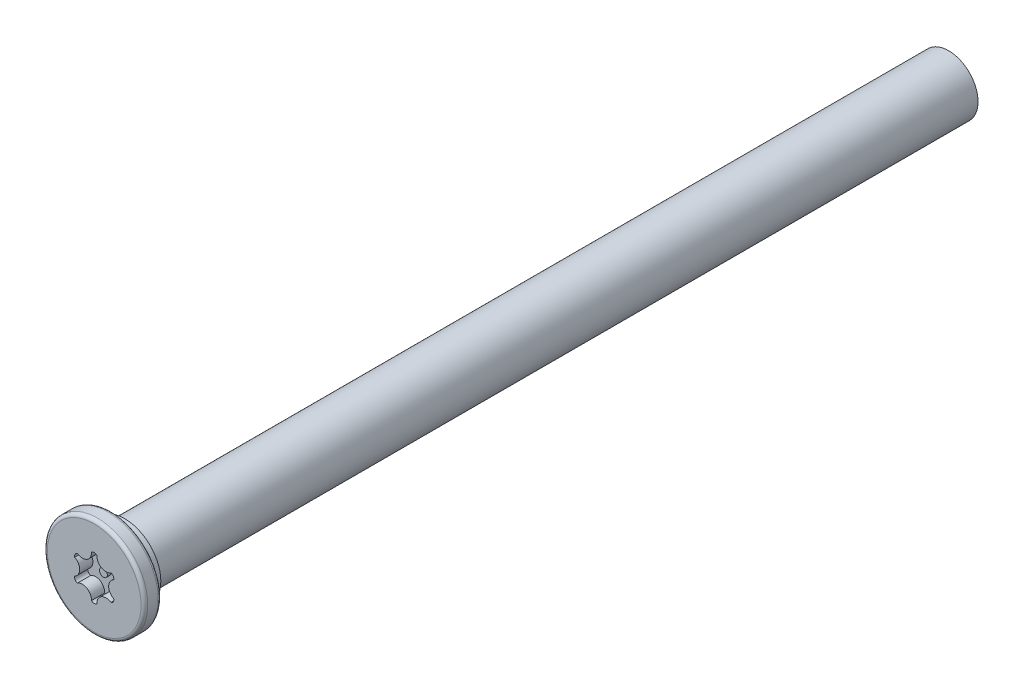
ISO-10303-21;
HEADER;
FILE_DESCRIPTION(('STEP AP214'),'2;1');
FILE_NAME('part.step','',(''),(''),'','','');
FILE_SCHEMA(('AUTOMOTIVE_DESIGN { 1 0 10303 214 1 1 1 1 }'));
ENDSEC;
DATA;
#1=APPLICATION_CONTEXT('core data for automotive mechanical design processes');
#2=APPLICATION_PROTOCOL_DEFINITION('international standard','automotive_design',2000,#1);
#3=PRODUCT_CONTEXT('',#1,'mechanical');
#4=PRODUCT('Part','Part','',(#3));
#5=PRODUCT_RELATED_PRODUCT_CATEGORY('part','',(#4));
#6=PRODUCT_DEFINITION_FORMATION('','',#4);
#7=PRODUCT_DEFINITION_CONTEXT('part definition',#1,'design');
#8=PRODUCT_DEFINITION('design','',#6,#7);
#9=PRODUCT_DEFINITION_SHAPE('','',#8);
#10=(LENGTH_UNIT() NAMED_UNIT(*) SI_UNIT(.MILLI.,.METRE.));
#11=(NAMED_UNIT(*) PLANE_ANGLE_UNIT() SI_UNIT($,.RADIAN.));
#12=(NAMED_UNIT(*) SI_UNIT($,.STERADIAN.) SOLID_ANGLE_UNIT());
#13=UNCERTAINTY_MEASURE_WITH_UNIT(LENGTH_MEASURE(1.E-05),#10,'distance_accuracy_value','');
#14=(GEOMETRIC_REPRESENTATION_CONTEXT(3) GLOBAL_UNCERTAINTY_ASSIGNED_CONTEXT((#13)) GLOBAL_UNIT_ASSIGNED_CONTEXT((#10,
#11,#12)) REPRESENTATION_CONTEXT('',''));
#15=CARTESIAN_POINT('',(0.,0.,0.));
#16=DIRECTION('',(0.,0.,1.));
#17=DIRECTION('',(1.,0.,0.));
#18=AXIS2_PLACEMENT_3D('',#15,#16,#17);
#19=CARTESIAN_POINT('',(0.,0.,0.));
#20=DIRECTION('',(0.,0.,1.));
#21=DIRECTION('',(1.,0.,0.));
#22=AXIS2_PLACEMENT_3D('',#19,#20,#21);
#23=PLANE('',#22);
#24=CARTESIAN_POINT('',(0.,0.,0.));
#25=DIRECTION('',(0.,0.,1.));
#26=DIRECTION('',(1.,0.,0.));
#27=AXIS2_PLACEMENT_3D('',#24,#25,#26);
#28=CIRCLE('',#27,3.55599999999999);
#29=CARTESIAN_POINT('',(3.55599999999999,0.,0.));
#30=VERTEX_POINT('',#29);
#31=EDGE_CURVE('E54',#30,#30,#28,.T.);
#32=ORIENTED_EDGE('',*,*,#31,.T.);
#33=EDGE_LOOP('',(#32));
#34=FACE_BOUND('',#33,.T.);
#35=CARTESIAN_POINT('',(0.893828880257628,1.54815703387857,0.));
#36=DIRECTION('',(0.,0.,1.));
#37=DIRECTION('',(1.,0.,0.));
#38=AXIS2_PLACEMENT_3D('',#35,#36,#37);
#39=CIRCLE('',#38,0.69);
#40=CARTESIAN_POINT('',(0.205060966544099,1.58937306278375,0.));
#41=VERTEX_POINT('',#40);
#42=CARTESIAN_POINT('',(1.27390696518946,0.972274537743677,0.));
#43=VERTEX_POINT('',#42);
#44=EDGE_CURVE('E181',#41,#43,#39,.T.);
#45=ORIENTED_EDGE('',*,*,#44,.T.);
#46=CARTESIAN_POINT('',(1.19884944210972,0.692156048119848,0.));
#47=DIRECTION('',(0.,0.,1.));
#48=DIRECTION('',(1.,0.,0.));
#49=AXIS2_PLACEMENT_3D('',#46,#47,#48);
#50=CIRCLE('',#49,0.29);
#51=CARTESIAN_POINT('',(1.47896793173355,0.617098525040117,0.));
#52=VERTEX_POINT('',#51);
#53=EDGE_CURVE('E61',#43,#52,#50,.F.);
#54=ORIENTED_EDGE('',*,*,#53,.T.);
#55=CARTESIAN_POINT('',(1.78765776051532,0.,0.));
#56=DIRECTION('',(0.,0.,1.));
#57=DIRECTION('',(1.,0.,0.));
#58=AXIS2_PLACEMENT_3D('',#55,#56,#57);
#59=CIRCLE('',#58,0.69);
#60=CARTESIAN_POINT('',(1.47896793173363,-0.617098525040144,0.));
#61=VERTEX_POINT('',#60);
#62=EDGE_CURVE('E111',#52,#61,#59,.T.);
#63=ORIENTED_EDGE('',*,*,#62,.T.);
#64=CARTESIAN_POINT('',(1.1988494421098,-0.692156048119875,0.));
#65=DIRECTION('',(0.,0.,1.));
#66=DIRECTION('',(1.,0.,0.));
#67=AXIS2_PLACEMENT_3D('',#64,#65,#66);
#68=CIRCLE('',#67,0.29);
#69=CARTESIAN_POINT('',(1.27390696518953,-0.972274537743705,0.));
#70=VERTEX_POINT('',#69);
#71=EDGE_CURVE('E216',#61,#70,#68,.F.);
#72=ORIENTED_EDGE('',*,*,#71,.T.);
#73=CARTESIAN_POINT('',(0.893828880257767,-1.54815703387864,0.));
#74=DIRECTION('',(0.,0.,1.));
#75=DIRECTION('',(1.,0.,0.));
#76=AXIS2_PLACEMENT_3D('',#73,#74,#75);
#77=CIRCLE('',#76,0.69);
#78=CARTESIAN_POINT('',(0.205060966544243,-1.5893730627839,0.));
#79=VERTEX_POINT('',#78);
#80=EDGE_CURVE('E160',#70,#79,#77,.T.);
#81=ORIENTED_EDGE('',*,*,#80,.T.);
#82=CARTESIAN_POINT('',(1.43067375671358E-13,-1.3843120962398,0.));
#83=DIRECTION('',(0.,0.,1.));
#84=DIRECTION('',(1.,0.,0.));
#85=AXIS2_PLACEMENT_3D('',#82,#83,#84);
#86=CIRCLE('',#85,0.29);
#87=CARTESIAN_POINT('',(-0.205060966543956,-1.5893730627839,0.));
#88=VERTEX_POINT('',#87);
#89=EDGE_CURVE('E210',#79,#88,#86,.F.);
#90=ORIENTED_EDGE('',*,*,#89,.T.);
#91=CARTESIAN_POINT('',(-0.893828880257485,-1.54815703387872,0.));
#92=DIRECTION('',(0.,0.,1.));
#93=DIRECTION('',(1.,0.,0.));
#94=AXIS2_PLACEMENT_3D('',#91,#92,#93);
#95=CIRCLE('',#94,0.69);
#96=CARTESIAN_POINT('',(-1.27390696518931,-0.97227453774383,0.));
#97=VERTEX_POINT('',#96);
#98=EDGE_CURVE('E206',#88,#97,#95,.T.);
#99=ORIENTED_EDGE('',*,*,#98,.T.);
#100=CARTESIAN_POINT('',(-1.19884944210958,-0.69215604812,0.));
#101=DIRECTION('',(0.,0.,1.));
#102=DIRECTION('',(1.,0.,0.));
#103=AXIS2_PLACEMENT_3D('',#100,#101,#102);
#104=CIRCLE('',#103,0.29);
#105=CARTESIAN_POINT('',(-1.47896793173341,-0.617098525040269,0.));
#106=VERTEX_POINT('',#105);
#107=EDGE_CURVE('E202',#97,#106,#104,.F.);
#108=ORIENTED_EDGE('',*,*,#107,.T.);
#109=CARTESIAN_POINT('',(-1.78765776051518,-1.56674837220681E-13,0.));
#110=DIRECTION('',(0.,0.,1.));
#111=DIRECTION('',(1.,0.,0.));
#112=AXIS2_PLACEMENT_3D('',#109,#110,#111);
#113=CIRCLE('',#112,0.69);
#114=CARTESIAN_POINT('',(-1.47896793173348,0.617098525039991,0.));
#115=VERTEX_POINT('',#114);
#116=EDGE_CURVE('E198',#106,#115,#113,.T.);
#117=ORIENTED_EDGE('',*,*,#116,.T.);
#118=CARTESIAN_POINT('',(-1.19884944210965,0.692156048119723,0.));
#119=DIRECTION('',(0.,0.,1.));
#120=DIRECTION('',(1.,0.,0.));
#121=AXIS2_PLACEMENT_3D('',#118,#119,#120);
#122=CIRCLE('',#121,0.29);
#123=CARTESIAN_POINT('',(-1.27390696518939,0.972274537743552,0.));
#124=VERTEX_POINT('',#123);
#125=EDGE_CURVE('E194',#115,#124,#122,.F.);
#126=ORIENTED_EDGE('',*,*,#125,.T.);
#127=CARTESIAN_POINT('',(-0.893828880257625,1.54815703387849,0.));
#128=DIRECTION('',(0.,0.,1.));
#129=DIRECTION('',(1.,0.,0.));
#130=AXIS2_PLACEMENT_3D('',#127,#128,#129);
#131=CIRCLE('',#130,0.690000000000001);
#132=CARTESIAN_POINT('',(-0.205060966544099,1.58937306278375,0.));
#133=VERTEX_POINT('',#132);
#134=EDGE_CURVE('E190',#124,#133,#131,.T.);
#135=ORIENTED_EDGE('',*,*,#134,.T.);
#136=CARTESIAN_POINT('',(0.,1.38431209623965,0.));
#137=DIRECTION('',(0.,0.,1.));
#138=DIRECTION('',(1.,0.,0.));
#139=AXIS2_PLACEMENT_3D('',#136,#137,#138);
#140=CIRCLE('',#139,0.29);
#141=EDGE_CURVE('E186',#133,#41,#140,.F.);
#142=ORIENTED_EDGE('',*,*,#141,.T.);
#143=EDGE_LOOP('',(#45,#54,#63,#72,#81,#90,#99,#108,#117,#126,#135,#142));
#144=FACE_BOUND('',#143,.T.);
#145=ADVANCED_FACE('F45',(#34,#144),#23,.T.);
#146=CARTESIAN_POINT('',(0.,0.,-1.3));
#147=DIRECTION('',(0.,0.,1.));
#148=DIRECTION('',(1.,0.,0.));
#149=AXIS2_PLACEMENT_3D('',#146,#147,#148);
#150=PLANE('',#149);
#151=CARTESIAN_POINT('',(0.,0.,-1.3));
#152=DIRECTION('',(0.,0.,1.));
#153=DIRECTION('',(1.,0.,0.));
#154=AXIS2_PLACEMENT_3D('',#151,#152,#153);
#155=CIRCLE('',#154,2.738000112);
#156=CARTESIAN_POINT('',(2.738000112,0.,-1.3));
#157=VERTEX_POINT('',#156);
#158=EDGE_CURVE('E11',#157,#157,#155,.F.);
#159=ORIENTED_EDGE('',*,*,#158,.F.);
#160=EDGE_LOOP('',(#159));
#161=FACE_BOUND('',#160,.T.);
#162=CARTESIAN_POINT('',(0.,0.,-1.3));
#163=DIRECTION('',(0.,0.,1.));
#164=DIRECTION('',(1.,0.,0.));
#165=AXIS2_PLACEMENT_3D('',#162,#163,#164);
#166=CIRCLE('',#165,3.55599999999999);
#167=CARTESIAN_POINT('',(3.55599999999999,0.,-1.3));
#168=VERTEX_POINT('',#167);
#169=EDGE_CURVE('E260',#168,#168,#166,.F.);
#170=ORIENTED_EDGE('',*,*,#169,.T.);
#171=EDGE_LOOP('',(#170));
#172=FACE_BOUND('',#171,.T.);
#173=ADVANCED_FACE('F283',(#161,#172),#150,.F.);
#174=CARTESIAN_POINT('',(0.,0.,-1.3));
#175=DIRECTION('',(0.,0.,1.));
#176=DIRECTION('',(1.,0.,0.));
#177=AXIS2_PLACEMENT_3D('',#174,#175,#176);
#178=CYLINDRICAL_SURFACE('',#177,3.80999999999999);
#179=CARTESIAN_POINT('',(0.,0.,-1.046));
#180=DIRECTION('',(0.,0.,1.));
#181=DIRECTION('',(1.,0.,0.));
#182=AXIS2_PLACEMENT_3D('',#179,#180,#181);
#183=CIRCLE('',#182,3.80999999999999);
#184=CARTESIAN_POINT('',(3.80999999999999,0.,-1.046));
#185=VERTEX_POINT('',#184);
#186=EDGE_CURVE('E256',#185,#185,#183,.T.);
#187=ORIENTED_EDGE('',*,*,#186,.T.);
#188=EDGE_LOOP('',(#187));
#189=FACE_BOUND('',#188,.T.);
#190=CARTESIAN_POINT('',(0.,0.,-0.254));
#191=DIRECTION('',(0.,0.,1.));
#192=DIRECTION('',(1.,0.,0.));
#193=AXIS2_PLACEMENT_3D('',#190,#191,#192);
#194=CIRCLE('',#193,3.80999999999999);
#195=CARTESIAN_POINT('',(3.80999999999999,0.,-0.254));
#196=VERTEX_POINT('',#195);
#197=EDGE_CURVE('E225',#196,#196,#194,.F.);
#198=ORIENTED_EDGE('',*,*,#197,.T.);
#199=EDGE_LOOP('',(#198));
#200=FACE_BOUND('',#199,.T.);
#201=ADVANCED_FACE('F289',(#189,#200),#178,.T.);
#202=CARTESIAN_POINT('',(1.19884944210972,0.692156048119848,-1.));
#203=DIRECTION('',(0.,0.,1.));
#204=DIRECTION('',(1.,0.,0.));
#205=AXIS2_PLACEMENT_3D('',#202,#203,#204);
#206=CYLINDRICAL_SURFACE('',#205,0.29);
#207=ORIENTED_EDGE('',*,*,#53,.F.);
#208=DIRECTION('',(0.,0.,1.));
#209=VECTOR('',#208,1.);
#210=CARTESIAN_POINT('',(1.27390696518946,0.972274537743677,-1.));
#211=LINE('',#210,#209);
#212=CARTESIAN_POINT('',(1.27390696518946,0.972274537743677,-1.));
#213=VERTEX_POINT('',#212);
#214=EDGE_CURVE('E178',#213,#43,#211,.T.);
#215=ORIENTED_EDGE('',*,*,#214,.F.);
#216=CARTESIAN_POINT('',(1.19884944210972,0.692156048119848,-1.));
#217=DIRECTION('',(0.,0.,1.));
#218=DIRECTION('',(1.,0.,0.));
#219=AXIS2_PLACEMENT_3D('',#216,#217,#218);
#220=CIRCLE('',#219,0.29);
#221=CARTESIAN_POINT('',(1.47896793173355,0.617098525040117,-1.));
#222=VERTEX_POINT('',#221);
#223=EDGE_CURVE('E221',#213,#222,#220,.F.);
#224=ORIENTED_EDGE('',*,*,#223,.T.);
#225=DIRECTION('',(0.,0.,1.));
#226=VECTOR('',#225,1.);
#227=CARTESIAN_POINT('',(1.47896793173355,0.617098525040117,-1.));
#228=LINE('',#227,#226);
#229=EDGE_CURVE('E222',#222,#52,#228,.T.);
#230=ORIENTED_EDGE('',*,*,#229,.T.);
#231=EDGE_LOOP('',(#207,#215,#224,#230));
#232=FACE_BOUND('',#231,.T.);
#233=ADVANCED_FACE('F294',(#232),#206,.F.);
#234=CARTESIAN_POINT('',(1.78765776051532,0.,-1.));
#235=DIRECTION('',(0.,0.,1.));
#236=DIRECTION('',(1.,0.,0.));
#237=AXIS2_PLACEMENT_3D('',#234,#235,#236);
#238=CYLINDRICAL_SURFACE('',#237,0.69);
#239=ORIENTED_EDGE('',*,*,#62,.F.);
#240=ORIENTED_EDGE('',*,*,#229,.F.);
#241=CARTESIAN_POINT('',(1.78765776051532,0.,-1.));
#242=DIRECTION('',(0.,0.,1.));
#243=DIRECTION('',(1.,0.,0.));
#244=AXIS2_PLACEMENT_3D('',#241,#242,#243);
#245=CIRCLE('',#244,0.69);
#246=CARTESIAN_POINT('',(1.47896793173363,-0.617098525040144,-1.));
#247=VERTEX_POINT('',#246);
#248=EDGE_CURVE('E70',#222,#247,#245,.T.);
#249=ORIENTED_EDGE('',*,*,#248,.T.);
#250=DIRECTION('',(0.,0.,1.));
#251=VECTOR('',#250,1.);
#252=CARTESIAN_POINT('',(1.47896793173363,-0.617098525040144,-1.));
#253=LINE('',#252,#251);
#254=EDGE_CURVE('E151',#247,#61,#253,.T.);
#255=ORIENTED_EDGE('',*,*,#254,.T.);
#256=EDGE_LOOP('',(#239,#240,#249,#255));
#257=FACE_BOUND('',#256,.T.);
#258=ADVANCED_FACE('F301',(#257),#238,.T.);
#259=CARTESIAN_POINT('',(1.1988494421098,-0.692156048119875,-1.));
#260=DIRECTION('',(0.,0.,1.));
#261=DIRECTION('',(1.,0.,0.));
#262=AXIS2_PLACEMENT_3D('',#259,#260,#261);
#263=CYLINDRICAL_SURFACE('',#262,0.29);
#264=ORIENTED_EDGE('',*,*,#71,.F.);
#265=ORIENTED_EDGE('',*,*,#254,.F.);
#266=CARTESIAN_POINT('',(1.1988494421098,-0.692156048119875,-1.));
#267=DIRECTION('',(0.,0.,1.));
#268=DIRECTION('',(1.,0.,0.));
#269=AXIS2_PLACEMENT_3D('',#266,#267,#268);
#270=CIRCLE('',#269,0.29);
#271=CARTESIAN_POINT('',(1.27390696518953,-0.972274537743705,-1.));
#272=VERTEX_POINT('',#271);
#273=EDGE_CURVE('E145',#247,#272,#270,.F.);
#274=ORIENTED_EDGE('',*,*,#273,.T.);
#275=DIRECTION('',(0.,0.,1.));
#276=VECTOR('',#275,1.);
#277=CARTESIAN_POINT('',(1.27390696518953,-0.972274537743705,-1.));
#278=LINE('',#277,#276);
#279=EDGE_CURVE('E149',#272,#70,#278,.T.);
#280=ORIENTED_EDGE('',*,*,#279,.T.);
#281=EDGE_LOOP('',(#264,#265,#274,#280));
#282=FACE_BOUND('',#281,.T.);
#283=ADVANCED_FACE('F148',(#282),#263,.F.);
#284=CARTESIAN_POINT('',(0.893828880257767,-1.54815703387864,-1.));
#285=DIRECTION('',(0.,0.,1.));
#286=DIRECTION('',(1.,0.,0.));
#287=AXIS2_PLACEMENT_3D('',#284,#285,#286);
#288=CYLINDRICAL_SURFACE('',#287,0.69);
#289=ORIENTED_EDGE('',*,*,#80,.F.);
#290=ORIENTED_EDGE('',*,*,#279,.F.);
#291=CARTESIAN_POINT('',(0.893828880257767,-1.54815703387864,-1.));
#292=DIRECTION('',(0.,0.,1.));
#293=DIRECTION('',(1.,0.,0.));
#294=AXIS2_PLACEMENT_3D('',#291,#292,#293);
#295=CIRCLE('',#294,0.69);
#296=CARTESIAN_POINT('',(0.205060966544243,-1.5893730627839,-1.));
#297=VERTEX_POINT('',#296);
#298=EDGE_CURVE('E154',#272,#297,#295,.T.);
#299=ORIENTED_EDGE('',*,*,#298,.T.);
#300=DIRECTION('',(0.,0.,1.));
#301=VECTOR('',#300,1.);
#302=CARTESIAN_POINT('',(0.205060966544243,-1.5893730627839,-1.));
#303=LINE('',#302,#301);
#304=EDGE_CURVE('E163',#297,#79,#303,.T.);
#305=ORIENTED_EDGE('',*,*,#304,.T.);
#306=EDGE_LOOP('',(#289,#290,#299,#305));
#307=FACE_BOUND('',#306,.T.);
#308=ADVANCED_FACE('F157',(#307),#288,.T.);
#309=CARTESIAN_POINT('',(1.43067375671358E-13,-1.3843120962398,-1.));
#310=DIRECTION('',(0.,0.,1.));
#311=DIRECTION('',(1.,0.,0.));
#312=AXIS2_PLACEMENT_3D('',#309,#310,#311);
#313=CYLINDRICAL_SURFACE('',#312,0.29);
#314=ORIENTED_EDGE('',*,*,#89,.F.);
#315=ORIENTED_EDGE('',*,*,#304,.F.);
#316=CARTESIAN_POINT('',(1.43067375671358E-13,-1.3843120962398,-1.));
#317=DIRECTION('',(0.,0.,1.));
#318=DIRECTION('',(1.,0.,0.));
#319=AXIS2_PLACEMENT_3D('',#316,#317,#318);
#320=CIRCLE('',#319,0.29);
#321=CARTESIAN_POINT('',(-0.205060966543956,-1.5893730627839,-1.));
#322=VERTEX_POINT('',#321);
#323=EDGE_CURVE('E168',#297,#322,#320,.F.);
#324=ORIENTED_EDGE('',*,*,#323,.T.);
#325=DIRECTION('',(0.,0.,1.));
#326=VECTOR('',#325,1.);
#327=CARTESIAN_POINT('',(-0.205060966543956,-1.5893730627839,-1.));
#328=LINE('',#327,#326);
#329=EDGE_CURVE('E230',#322,#88,#328,.T.);
#330=ORIENTED_EDGE('',*,*,#329,.T.);
#331=EDGE_LOOP('',(#314,#315,#324,#330));
#332=FACE_BOUND('',#331,.T.);
#333=ADVANCED_FACE('F318',(#332),#313,.F.);
#334=CARTESIAN_POINT('',(-0.893828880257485,-1.54815703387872,-1.));
#335=DIRECTION('',(0.,0.,1.));
#336=DIRECTION('',(1.,0.,0.));
#337=AXIS2_PLACEMENT_3D('',#334,#335,#336);
#338=CYLINDRICAL_SURFACE('',#337,0.69);
#339=ORIENTED_EDGE('',*,*,#98,.F.);
#340=ORIENTED_EDGE('',*,*,#329,.F.);
#341=CARTESIAN_POINT('',(-0.893828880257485,-1.54815703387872,-1.));
#342=DIRECTION('',(0.,0.,1.));
#343=DIRECTION('',(1.,0.,0.));
#344=AXIS2_PLACEMENT_3D('',#341,#342,#343);
#345=CIRCLE('',#344,0.69);
#346=CARTESIAN_POINT('',(-1.27390696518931,-0.97227453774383,-1.));
#347=VERTEX_POINT('',#346);
#348=EDGE_CURVE('E172',#322,#347,#345,.T.);
#349=ORIENTED_EDGE('',*,*,#348,.T.);
#350=DIRECTION('',(0.,0.,1.));
#351=VECTOR('',#350,1.);
#352=CARTESIAN_POINT('',(-1.27390696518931,-0.97227453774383,-1.));
#353=LINE('',#352,#351);
#354=EDGE_CURVE('E233',#347,#97,#353,.T.);
#355=ORIENTED_EDGE('',*,*,#354,.T.);
#356=EDGE_LOOP('',(#339,#340,#349,#355));
#357=FACE_BOUND('',#356,.T.);
#358=ADVANCED_FACE('F321',(#357),#338,.T.);
#359=CARTESIAN_POINT('',(-1.19884944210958,-0.69215604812,-1.));
#360=DIRECTION('',(0.,0.,1.));
#361=DIRECTION('',(1.,0.,0.));
#362=AXIS2_PLACEMENT_3D('',#359,#360,#361);
#363=CYLINDRICAL_SURFACE('',#362,0.29);
#364=ORIENTED_EDGE('',*,*,#107,.F.);
#365=ORIENTED_EDGE('',*,*,#354,.F.);
#366=CARTESIAN_POINT('',(-1.19884944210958,-0.69215604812,-1.));
#367=DIRECTION('',(0.,0.,1.));
#368=DIRECTION('',(1.,0.,0.));
#369=AXIS2_PLACEMENT_3D('',#366,#367,#368);
#370=CIRCLE('',#369,0.29);
#371=CARTESIAN_POINT('',(-1.47896793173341,-0.617098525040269,-1.));
#372=VERTEX_POINT('',#371);
#373=EDGE_CURVE('E374',#347,#372,#370,.F.);
#374=ORIENTED_EDGE('',*,*,#373,.T.);
#375=DIRECTION('',(0.,0.,1.));
#376=VECTOR('',#375,1.);
#377=CARTESIAN_POINT('',(-1.47896793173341,-0.617098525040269,-1.));
#378=LINE('',#377,#376);
#379=EDGE_CURVE('E236',#372,#106,#378,.T.);
#380=ORIENTED_EDGE('',*,*,#379,.T.);
#381=EDGE_LOOP('',(#364,#365,#374,#380));
#382=FACE_BOUND('',#381,.T.);
#383=ADVANCED_FACE('F325',(#382),#363,.F.);
#384=CARTESIAN_POINT('',(-1.78765776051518,-1.56674837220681E-13,-1.));
#385=DIRECTION('',(0.,0.,1.));
#386=DIRECTION('',(1.,0.,0.));
#387=AXIS2_PLACEMENT_3D('',#384,#385,#386);
#388=CYLINDRICAL_SURFACE('',#387,0.69);
#389=ORIENTED_EDGE('',*,*,#116,.F.);
#390=ORIENTED_EDGE('',*,*,#379,.F.);
#391=CARTESIAN_POINT('',(-1.78765776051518,-1.56674837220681E-13,-1.));
#392=DIRECTION('',(0.,0.,1.));
#393=DIRECTION('',(1.,0.,0.));
#394=AXIS2_PLACEMENT_3D('',#391,#392,#393);
#395=CIRCLE('',#394,0.69);
#396=CARTESIAN_POINT('',(-1.47896793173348,0.617098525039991,-1.));
#397=VERTEX_POINT('',#396);
#398=EDGE_CURVE('E371',#372,#397,#395,.T.);
#399=ORIENTED_EDGE('',*,*,#398,.T.);
#400=DIRECTION('',(0.,0.,1.));
#401=VECTOR('',#400,1.);
#402=CARTESIAN_POINT('',(-1.47896793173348,0.617098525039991,-1.));
#403=LINE('',#402,#401);
#404=EDGE_CURVE('E239',#397,#115,#403,.T.);
#405=ORIENTED_EDGE('',*,*,#404,.T.);
#406=EDGE_LOOP('',(#389,#390,#399,#405));
#407=FACE_BOUND('',#406,.T.);
#408=ADVANCED_FACE('F329',(#407),#388,.T.);
#409=CARTESIAN_POINT('',(-1.19884944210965,0.692156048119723,-1.));
#410=DIRECTION('',(0.,0.,1.));
#411=DIRECTION('',(1.,0.,0.));
#412=AXIS2_PLACEMENT_3D('',#409,#410,#411);
#413=CYLINDRICAL_SURFACE('',#412,0.29);
#414=ORIENTED_EDGE('',*,*,#125,.F.);
#415=ORIENTED_EDGE('',*,*,#404,.F.);
#416=CARTESIAN_POINT('',(-1.19884944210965,0.692156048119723,-1.));
#417=DIRECTION('',(0.,0.,1.));
#418=DIRECTION('',(1.,0.,0.));
#419=AXIS2_PLACEMENT_3D('',#416,#417,#418);
#420=CIRCLE('',#419,0.29);
#421=CARTESIAN_POINT('',(-1.27390696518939,0.972274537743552,-1.));
#422=VERTEX_POINT('',#421);
#423=EDGE_CURVE('E364',#397,#422,#420,.F.);
#424=ORIENTED_EDGE('',*,*,#423,.T.);
#425=DIRECTION('',(0.,0.,1.));
#426=VECTOR('',#425,1.);
#427=CARTESIAN_POINT('',(-1.27390696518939,0.972274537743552,-1.));
#428=LINE('',#427,#426);
#429=EDGE_CURVE('E242',#422,#124,#428,.T.);
#430=ORIENTED_EDGE('',*,*,#429,.T.);
#431=EDGE_LOOP('',(#414,#415,#424,#430));
#432=FACE_BOUND('',#431,.T.);
#433=ADVANCED_FACE('F333',(#432),#413,.F.);
#434=CARTESIAN_POINT('',(-0.893828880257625,1.54815703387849,-1.));
#435=DIRECTION('',(0.,0.,1.));
#436=DIRECTION('',(1.,0.,0.));
#437=AXIS2_PLACEMENT_3D('',#434,#435,#436);
#438=CYLINDRICAL_SURFACE('',#437,0.690000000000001);
#439=ORIENTED_EDGE('',*,*,#134,.F.);
#440=ORIENTED_EDGE('',*,*,#429,.F.);
#441=CARTESIAN_POINT('',(-0.893828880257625,1.54815703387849,-1.));
#442=DIRECTION('',(0.,0.,1.));
#443=DIRECTION('',(1.,0.,0.));
#444=AXIS2_PLACEMENT_3D('',#441,#442,#443);
#445=CIRCLE('',#444,0.690000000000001);
#446=CARTESIAN_POINT('',(-0.205060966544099,1.58937306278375,-1.));
#447=VERTEX_POINT('',#446);
#448=EDGE_CURVE('E360',#422,#447,#445,.T.);
#449=ORIENTED_EDGE('',*,*,#448,.T.);
#450=DIRECTION('',(0.,0.,1.));
#451=VECTOR('',#450,1.);
#452=CARTESIAN_POINT('',(-0.205060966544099,1.58937306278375,-1.));
#453=LINE('',#452,#451);
#454=EDGE_CURVE('E245',#447,#133,#453,.T.);
#455=ORIENTED_EDGE('',*,*,#454,.T.);
#456=EDGE_LOOP('',(#439,#440,#449,#455));
#457=FACE_BOUND('',#456,.T.);
#458=ADVANCED_FACE('F337',(#457),#438,.T.);
#459=CARTESIAN_POINT('',(0.,1.38431209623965,-1.));
#460=DIRECTION('',(0.,0.,1.));
#461=DIRECTION('',(1.,0.,0.));
#462=AXIS2_PLACEMENT_3D('',#459,#460,#461);
#463=CYLINDRICAL_SURFACE('',#462,0.29);
#464=ORIENTED_EDGE('',*,*,#141,.F.);
#465=ORIENTED_EDGE('',*,*,#454,.F.);
#466=CARTESIAN_POINT('',(0.,1.38431209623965,-1.));
#467=DIRECTION('',(0.,0.,1.));
#468=DIRECTION('',(1.,0.,0.));
#469=AXIS2_PLACEMENT_3D('',#466,#467,#468);
#470=CIRCLE('',#469,0.29);
#471=CARTESIAN_POINT('',(0.205060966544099,1.58937306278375,-1.));
#472=VERTEX_POINT('',#471);
#473=EDGE_CURVE('E357',#447,#472,#470,.F.);
#474=ORIENTED_EDGE('',*,*,#473,.T.);
#475=DIRECTION('',(0.,0.,1.));
#476=VECTOR('',#475,1.);
#477=CARTESIAN_POINT('',(0.205060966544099,1.58937306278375,-1.));
#478=LINE('',#477,#476);
#479=EDGE_CURVE('E248',#472,#41,#478,.T.);
#480=ORIENTED_EDGE('',*,*,#479,.T.);
#481=EDGE_LOOP('',(#464,#465,#474,#480));
#482=FACE_BOUND('',#481,.T.);
#483=ADVANCED_FACE('F341',(#482),#463,.F.);
#484=CARTESIAN_POINT('',(0.893828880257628,1.54815703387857,-1.));
#485=DIRECTION('',(0.,0.,1.));
#486=DIRECTION('',(1.,0.,0.));
#487=AXIS2_PLACEMENT_3D('',#484,#485,#486);
#488=CYLINDRICAL_SURFACE('',#487,0.69);
#489=ORIENTED_EDGE('',*,*,#44,.F.);
#490=ORIENTED_EDGE('',*,*,#479,.F.);
#491=CARTESIAN_POINT('',(0.893828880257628,1.54815703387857,-1.));
#492=DIRECTION('',(0.,0.,1.));
#493=DIRECTION('',(1.,0.,0.));
#494=AXIS2_PLACEMENT_3D('',#491,#492,#493);
#495=CIRCLE('',#494,0.69);
#496=EDGE_CURVE('E118',#472,#213,#495,.T.);
#497=ORIENTED_EDGE('',*,*,#496,.T.);
#498=ORIENTED_EDGE('',*,*,#214,.T.);
#499=EDGE_LOOP('',(#489,#490,#497,#498));
#500=FACE_BOUND('',#499,.T.);
#501=ADVANCED_FACE('F344',(#500),#488,.T.);
#502=CARTESIAN_POINT('',(0.,0.,-1.));
#503=DIRECTION('',(0.,0.,1.));
#504=DIRECTION('',(1.,0.,0.));
#505=AXIS2_PLACEMENT_3D('',#502,#503,#504);
#506=PLANE('',#505);
#507=CARTESIAN_POINT('',(0.,0.,-1.));
#508=DIRECTION('',(0.,0.,1.));
#509=DIRECTION('',(1.,0.,0.));
#510=AXIS2_PLACEMENT_3D('',#507,#508,#509);
#511=CIRCLE('',#510,0.3);
#512=CARTESIAN_POINT('',(0.3,0.,-1.));
#513=VERTEX_POINT('',#512);
#514=EDGE_CURVE('E396',#513,#513,#511,.T.);
#515=ORIENTED_EDGE('',*,*,#514,.F.);
#516=EDGE_LOOP('',(#515));
#517=FACE_BOUND('',#516,.T.);
#518=ORIENTED_EDGE('',*,*,#223,.F.);
#519=ORIENTED_EDGE('',*,*,#496,.F.);
#520=ORIENTED_EDGE('',*,*,#473,.F.);
#521=ORIENTED_EDGE('',*,*,#448,.F.);
#522=ORIENTED_EDGE('',*,*,#423,.F.);
#523=ORIENTED_EDGE('',*,*,#398,.F.);
#524=ORIENTED_EDGE('',*,*,#373,.F.);
#525=ORIENTED_EDGE('',*,*,#348,.F.);
#526=ORIENTED_EDGE('',*,*,#323,.F.);
#527=ORIENTED_EDGE('',*,*,#298,.F.);
#528=ORIENTED_EDGE('',*,*,#273,.F.);
#529=ORIENTED_EDGE('',*,*,#248,.F.);
#530=EDGE_LOOP('',(#518,#519,#520,#521,#522,#523,#524,#525,#526,#527,#528,#529));
#531=FACE_BOUND('',#530,.T.);
#532=ADVANCED_FACE('F166',(#517,#531),#506,.T.);
#533=CARTESIAN_POINT('',(0.,0.,-1.046));
#534=DIRECTION('',(0.,0.,1.));
#535=DIRECTION('',(1.,0.,0.));
#536=AXIS2_PLACEMENT_3D('',#533,#534,#535);
#537=TOROIDAL_SURFACE('',#536,3.55599999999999,0.254);
#538=ORIENTED_EDGE('',*,*,#169,.F.);
#539=EDGE_LOOP('',(#538));
#540=FACE_BOUND('',#539,.T.);
#541=ORIENTED_EDGE('',*,*,#186,.F.);
#542=EDGE_LOOP('',(#541));
#543=FACE_BOUND('',#542,.T.);
#544=ADVANCED_FACE('F271',(#540,#543),#537,.T.);
#545=CARTESIAN_POINT('',(0.,0.,-0.254));
#546=DIRECTION('',(0.,0.,1.));
#547=DIRECTION('',(1.,0.,0.));
#548=AXIS2_PLACEMENT_3D('',#545,#546,#547);
#549=TOROIDAL_SURFACE('',#548,3.55599999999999,0.254);
#550=ORIENTED_EDGE('',*,*,#197,.F.);
#551=EDGE_LOOP('',(#550));
#552=FACE_BOUND('',#551,.T.);
#553=ORIENTED_EDGE('',*,*,#31,.F.);
#554=EDGE_LOOP('',(#553));
#555=FACE_BOUND('',#554,.T.);
#556=ADVANCED_FACE('F47',(#552,#555),#549,.T.);
#557=CARTESIAN_POINT('',(0.,0.,-2.316));
#558=DIRECTION('',(0.,0.,-1.));
#559=DIRECTION('',(-1.,0.,0.));
#560=AXIS2_PLACEMENT_3D('',#557,#558,#559);
#561=PLANE('',#560);
#562=CARTESIAN_POINT('',(0.,0.,-2.316));
#563=DIRECTION('',(0.,0.,-1.));
#564=DIRECTION('',(-1.,0.,0.));
#565=AXIS2_PLACEMENT_3D('',#562,#563,#564);
#566=CIRCLE('',#565,2.738000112);
#567=CARTESIAN_POINT('',(-2.738000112,0.,-2.316));
#568=VERTEX_POINT('',#567);
#569=EDGE_CURVE('E182',#568,#568,#566,.T.);
#570=ORIENTED_EDGE('',*,*,#569,.T.);
#571=EDGE_LOOP('',(#570));
#572=FACE_BOUND('',#571,.T.);
#573=CARTESIAN_POINT('',(0.,0.,-2.316));
#574=DIRECTION('',(0.,0.,-1.));
#575=DIRECTION('',(-1.,0.,0.));
#576=AXIS2_PLACEMENT_3D('',#573,#574,#575);
#577=CIRCLE('',#576,2.230000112);
#578=CARTESIAN_POINT('',(-2.230000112,0.,-2.316));
#579=VERTEX_POINT('',#578);
#580=EDGE_CURVE('E400',#579,#579,#577,.T.);
#581=ORIENTED_EDGE('',*,*,#580,.F.);
#582=EDGE_LOOP('',(#581));
#583=FACE_BOUND('',#582,.T.);
#584=ADVANCED_FACE('F270',(#572,#583),#561,.T.);
#585=CARTESIAN_POINT('',(0.,0.,-2.316));
#586=DIRECTION('',(0.,0.,1.));
#587=DIRECTION('',(1.,0.,0.));
#588=AXIS2_PLACEMENT_3D('',#585,#586,#587);
#589=CYLINDRICAL_SURFACE('',#588,2.738000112);
#590=ORIENTED_EDGE('',*,*,#569,.F.);
#591=EDGE_LOOP('',(#590));
#592=FACE_BOUND('',#591,.T.);
#593=ORIENTED_EDGE('',*,*,#158,.T.);
#594=EDGE_LOOP('',(#593));
#595=FACE_BOUND('',#594,.T.);
#596=ADVANCED_FACE('F277',(#592,#595),#589,.T.);
#597=CARTESIAN_POINT('',(0.,0.,-0.7));
#598=DIRECTION('',(0.,0.,-1.));
#599=DIRECTION('',(-1.,0.,0.));
#600=AXIS2_PLACEMENT_3D('',#597,#598,#599);
#601=CYLINDRICAL_SURFACE('',#600,0.3);
#602=CARTESIAN_POINT('',(0.,0.,-0.7));
#603=DIRECTION('',(0.,0.,1.));
#604=DIRECTION('',(1.,0.,0.));
#605=AXIS2_PLACEMENT_3D('',#602,#603,#604);
#606=CIRCLE('',#605,0.3);
#607=CARTESIAN_POINT('',(0.3,0.,-0.7));
#608=VERTEX_POINT('',#607);
#609=EDGE_CURVE('E395',#608,#608,#606,.T.);
#610=ORIENTED_EDGE('',*,*,#609,.F.);
#611=EDGE_LOOP('',(#610));
#612=FACE_BOUND('',#611,.T.);
#613=ORIENTED_EDGE('',*,*,#514,.T.);
#614=EDGE_LOOP('',(#613));
#615=FACE_BOUND('',#614,.T.);
#616=ADVANCED_FACE('F424',(#612,#615),#601,.T.);
#617=CARTESIAN_POINT('',(0.,0.,-0.7));
#618=DIRECTION('',(0.,0.,1.));
#619=DIRECTION('',(1.,0.,0.));
#620=AXIS2_PLACEMENT_3D('',#617,#618,#619);
#621=PLANE('',#620);
#622=ORIENTED_EDGE('',*,*,#609,.T.);
#623=EDGE_LOOP('',(#622));
#624=FACE_BOUND('',#623,.T.);
#625=ADVANCED_FACE('F416',(#624),#621,.T.);
#626=CARTESIAN_POINT('',(0.,0.,-64.8));
#627=DIRECTION('',(0.,0.,1.));
#628=DIRECTION('',(1.,0.,0.));
#629=AXIS2_PLACEMENT_3D('',#626,#627,#628);
#630=CYLINDRICAL_SURFACE('',#629,2.230000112);
#631=ORIENTED_EDGE('',*,*,#580,.T.);
#632=EDGE_LOOP('',(#631));
#633=FACE_BOUND('',#632,.T.);
#634=CARTESIAN_POINT('',(0.,0.,-64.8));
#635=DIRECTION('',(0.,0.,-1.));
#636=DIRECTION('',(-1.,0.,0.));
#637=AXIS2_PLACEMENT_3D('',#634,#635,#636);
#638=CIRCLE('',#637,2.230000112);
#639=CARTESIAN_POINT('',(-2.230000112,0.,-64.8));
#640=VERTEX_POINT('',#639);
#641=EDGE_CURVE('E407',#640,#640,#638,.T.);
#642=ORIENTED_EDGE('',*,*,#641,.F.);
#643=EDGE_LOOP('',(#642));
#644=FACE_BOUND('',#643,.T.);
#645=ADVANCED_FACE('F414',(#633,#644),#630,.T.);
#646=CARTESIAN_POINT('',(0.,0.,-64.8));
#647=DIRECTION('',(0.,0.,-1.));
#648=DIRECTION('',(-1.,0.,0.));
#649=AXIS2_PLACEMENT_3D('',#646,#647,#648);
#650=PLANE('',#649);
#651=ORIENTED_EDGE('',*,*,#641,.T.);
#652=EDGE_LOOP('',(#651));
#653=FACE_BOUND('',#652,.T.);
#654=ADVANCED_FACE('F412',(#653),#650,.T.);
#655=CLOSED_SHELL('',(#145,#173,#201,#233,#258,#283,#308,#333,#358,#383,#408,#433,#458,#483,
#501,#532,#544,#556,#584,#596,#616,#625,#645,#654));
#656=MANIFOLD_SOLID_BREP('B2',#655);
#657=ADVANCED_BREP_SHAPE_REPRESENTATION('',(#18,#656),#14);
#658=SHAPE_DEFINITION_REPRESENTATION(#9,#657);
ENDSEC;
END-ISO-10303-21;
